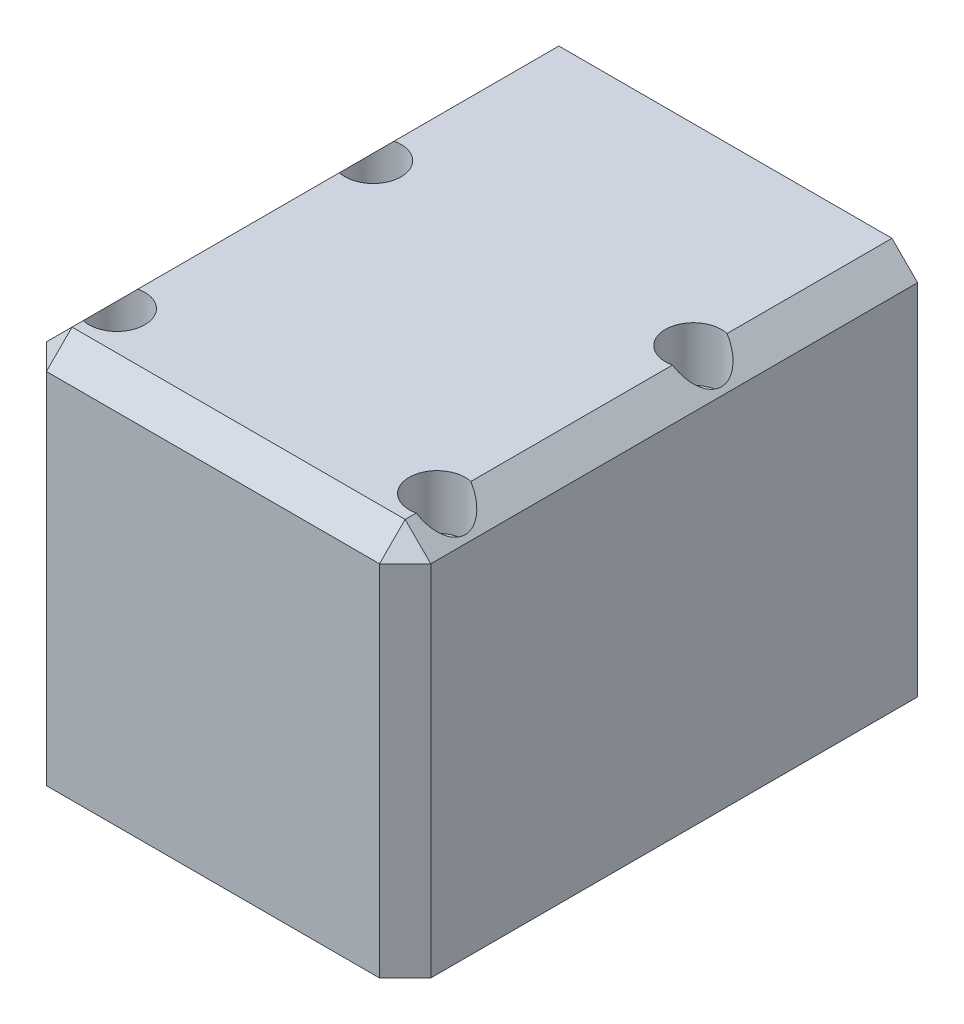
from build123d import *

# Parameters (mm, degrees)
SKETCH1_W                                      = 38.1
SKETCH1_H                                      = 38.1
EXTRUDE1_DEPTH                                 = 50.8
SKETCH2_R                                      = 13.97
CUT_EXTRUDE1_DEPTH                             = 44.45
F_4_40_TAPPED_HOLE1_D                          = 2.2606
F_4_40_TAPPED_HOLE1_DEPTH                      = 8.8646
F_4_40_TAPPED_HOLE1_TIP                        = 0.679152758
CHAMFER1_SIZE                                  = 2.54
SKETCH5_R                                      = 9.525
CUT_EXTRUDE2_DEPTH                             = 12.7
CBORE_FOR_4_SOCKET_HEAD_CAP_SCREW1_D           = 3.2639
CBORE_FOR_4_SOCKET_HEAD_CAP_SCREW1_CBORE_D     = 5.55752
CBORE_FOR_4_SOCKET_HEAD_CAP_SCREW1_CBORE_DEPTH = 5.3848


with BuildPart() as part:
    # Sketch1 → Extrude1 (new body)
    with BuildSketch(Plane.XY):
        with Locations((19.05, 19.05)):
            Rectangle(SKETCH1_W, SKETCH1_H)
    extrude(amount=EXTRUDE1_DEPTH)

    # Sketch2 → Cut-Extrude1 (cut)
    with BuildSketch(Plane(origin=(0, 0, 0), x_dir=(-1, 0, 0), z_dir=(0, 0, -1))):
        with Locations((-19.05, 19.05)):
            Circle(SKETCH2_R)
    extrude(amount=-CUT_EXTRUDE1_DEPTH, mode=Mode.SUBTRACT)

    # 4-40 Tapped Hole1
    with Locations(Plane(origin=(0, 0, 0), x_dir=(-1, 0, 0), z_dir=(0, 0, -1))):
        with Locations((-6.745, 31.355), (-6.745, 6.745), (-31.355, 6.745), (-31.355, 31.355)):
            Hole(F_4_40_TAPPED_HOLE1_D / 2, depth=F_4_40_TAPPED_HOLE1_DEPTH)
            with Locations((0, 0, -(F_4_40_TAPPED_HOLE1_DEPTH + F_4_40_TAPPED_HOLE1_TIP / 2))):  # 118° drill point
                Cone(0, F_4_40_TAPPED_HOLE1_D / 2, F_4_40_TAPPED_HOLE1_TIP, mode=Mode.SUBTRACT)

    # Chamfer1
    chamfer1_edges = [part.edges().sort_by_distance(p)[0] for p in [
        (38.1, 19.05, 50.8),
        (19.05, 38.1, 50.8),
        (0, 19.05, 50.8),
        (0, 38.1, 25.4),
        (38.1, 38.1, 25.4),
    ]]
    chamfer(chamfer1_edges, length=CHAMFER1_SIZE)

    # Sketch5 → Cut-Extrude2 (cut)
    with BuildSketch(Plane.XZ):
        with Locations(Location((19.05, 34.798, 0), (0, 0, 270))):
            Circle(SKETCH5_R)
    extrude(amount=-CUT_EXTRUDE2_DEPTH, mode=Mode.SUBTRACT)

    # CBORE for _4 Socket Head Cap Screw1 (through all)
    with Locations(Plane(origin=(0, 38.1, 0), x_dir=(-1, 0, 0), z_dir=(0, 1, 0))):
        with Locations((-34.925, 44.45), (-34.925, 19.05), (-3.175, 19.05), (-3.175, 44.45)):
            CounterBoreHole(CBORE_FOR_4_SOCKET_HEAD_CAP_SCREW1_D / 2, CBORE_FOR_4_SOCKET_HEAD_CAP_SCREW1_CBORE_D / 2, CBORE_FOR_4_SOCKET_HEAD_CAP_SCREW1_CBORE_DEPTH)


solid = part.part
